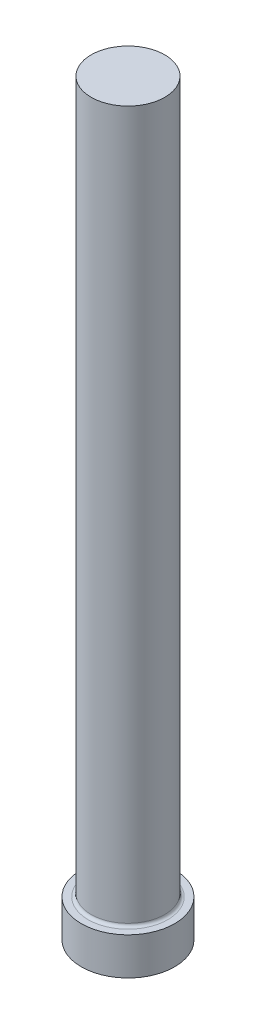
from build123d import *


with BuildPart() as part:
    # Sketch1 → Revolve3 (revolve)
    with BuildSketch(Plane.XY, mode=Mode.PRIVATE) as revolve3_sk:
        with BuildLine():
            Line((0, 0), (3.9624, 0))
            Line((3.9624, 0), (3.9624, 3.175))
            Line((3.9624, 3.175), (3.3782, 3.175))
            ThreePointArc((3.3782, 3.175), (3.198594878, 3.249394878), (3.1242, 3.429))
            Line((3.1242, 3.429), (3.1242, 63.5))
            Line((3.1242, 63.5), (0, 63.5))
            Line((0, 63.5), (0, 0))
        make_face()
    revolve(revolve3_sk.sketch.rotate(Axis((0, 0, 0), (0, -1, 0)), 90), axis=Axis((0, 0, 0), (0, -1, 0)))


solid = part.part
